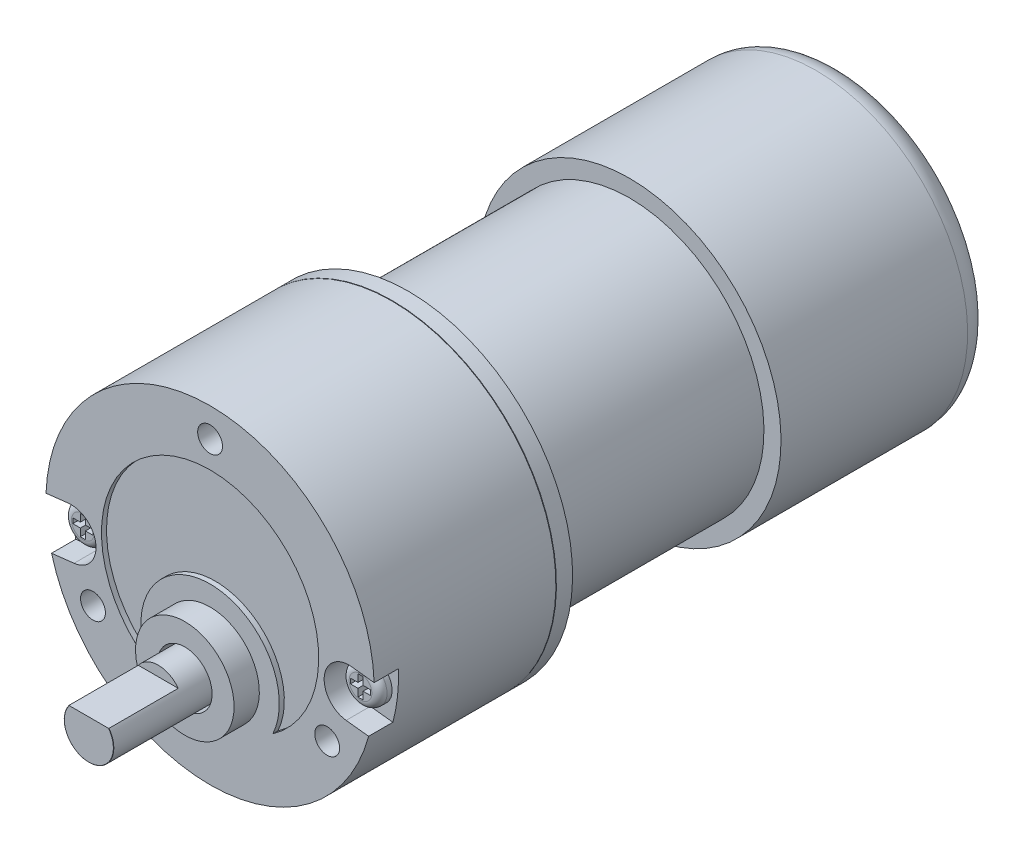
from build123d import *

# Parameters (mm, degrees)
SKETCH2_R                 = 4.953
SKETCH2_R_2               = 2.7432
BOSS_EXTRUDE1_DEPTH       = 2.54
SKETCH2_4_R               = 2.4892
BOSS_EXTRUDE2_DEPTH       = 12.192
CUT_EXTRUDE1_DEPTH        = 0.508
CUT_EXTRUDE4_DEPTH        = 2.4384
M3X0_5_TAPPED_HOLE1_D     = 2.5
M3X0_5_TAPPED_HOLE1_DEPTH = 7.62
M3X0_5_TAPPED_HOLE1_TIP   = 0.751075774
SKETCH7_R                 = 1.905
BOSS_EXTRUDE3_DEPTH       = 1.27
FILLET1_R                 = 0.762
CUT_EXTRUDE5_START        = -6.985
CUT_EXTRUDE5_DEPTH        = 6.985
FILLET2_R                 = 0.0254


with BuildPart() as part:
    # Sketch1 → Revolve1 (revolve)
    with BuildSketch(Plane(origin=(0, 0, 0), x_dir=(0, 0, -1), z_dir=(1, 0, 0))):
        with BuildLine():
            ThreePointArc((65.649974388, 2.168025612), (66.314610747, 1.173327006), (66.548, 0))
            Line((66.548, 0), (64.751948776, 0))
            Line((64.751948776, 0), (0, 0))
            Line((0, 0), (0, 16.51))
            Line((0, 16.51), (18.2626, 16.51))
            Line((18.2626, 16.51), (18.288, 16.4846))
            Line((18.288, 16.4846), (18.3134, 16.51))
            Line((18.3134, 16.51), (19.939, 16.51))
            Line((19.939, 16.51), (19.939, 13.5255))
            Line((19.939, 13.5255), (42.164, 13.5255))
            Line((42.164, 13.5255), (42.164, 15.24))
            Line((42.164, 15.24), (60.928703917, 15.24))
            ThreePointArc((60.928703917, 15.24), (62.640608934, 14.57642778), (63.458047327, 12.932426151))
            Line((63.458047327, 12.932426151), (64.321298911, 3.538217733))
            ThreePointArc((64.321298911, 3.538217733), (64.33278249, 3.495915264), (64.35796352, 3.46003648))
            Line((64.35796352, 3.46003648), (65.649974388, 2.168025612))
        make_face()
    revolve(axis=Axis((0, 0, -64.751948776), (0, 0, 1)))

    # Sketch2 → Boss-Extrude1 (add)
    with BuildSketch(Plane.XY):
        with Locations(Location((0, -5.969, 0), (0, 0, 90))):
            Circle(SKETCH2_R)
        with Locations((0, -5.969)):
            Circle(SKETCH2_R_2, mode=Mode.SUBTRACT)
    extrude(amount=BOSS_EXTRUDE1_DEPTH)

    # Sketch2_4 → Boss-Extrude2 (add)
    with BuildSketch(Plane.XY):
        with Locations(Location((0, -5.969, 0), (0, 0, 180))):
            Circle(SKETCH2_4_R)
    extrude(amount=BOSS_EXTRUDE2_DEPTH)

    # Sketch2_5 → Cut-Extrude1 (cut)
    with BuildSketch(Plane.XY):
        with BuildLine():
            ThreePointArc((6.303140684, -8.919669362), (0, 0.9906), (-6.303140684, -8.919669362))
            ThreePointArc((-6.303140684, -8.919669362), (0, 10.922), (6.303140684, -8.919669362))
        make_face()
    extrude(amount=-CUT_EXTRUDE1_DEPTH, mode=Mode.SUBTRACT)

    # Sketch2_6 → Cut-Extrude4 (cut)
    with BuildSketch(Plane.XY):
        with BuildLine():
            Line((-16.710358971, 0.61601369), (-16.151132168, -4.330877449))
            Line((-16.151132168, -4.330877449), (-13.677686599, -4.051264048))
            ThreePointArc((-13.677686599, -4.051264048), (-11.48385443, -1.298205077), (-14.236913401, 0.895627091))
            Line((-14.236913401, 0.895627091), (-16.710358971, 0.61601369))
        make_face()
        with BuildLine():
            Line((16.710358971, 0.61601369), (14.236913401, 0.895627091))
            ThreePointArc((14.236913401, 0.895627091), (11.48385443, -1.298205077), (13.677686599, -4.051264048))
            Line((13.677686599, -4.051264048), (16.151132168, -4.330877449))
            Line((16.151132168, -4.330877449), (16.710358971, 0.61601369))
        make_face()
    extrude(amount=-CUT_EXTRUDE4_DEPTH, mode=Mode.SUBTRACT)

    # M3x0.5 Tapped Hole1
    with Locations(Plane.XY):
        with Locations((0, 13.594173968), (-11.7729, -6.797086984), (11.7729, -6.797086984)):
            Hole(M3X0_5_TAPPED_HOLE1_D / 2, depth=M3X0_5_TAPPED_HOLE1_DEPTH)
            with Locations((0, 0, -(M3X0_5_TAPPED_HOLE1_DEPTH + M3X0_5_TAPPED_HOLE1_TIP / 2))):  # 118° drill point
                Cone(0, M3X0_5_TAPPED_HOLE1_D / 2, M3X0_5_TAPPED_HOLE1_TIP, mode=Mode.SUBTRACT)

    # Sketch7 → Boss-Extrude3 (add)
    # profile 1 of 2: a face of its own
    with BuildSketch(Plane.XY.offset(-2.4384)):
        with Locations((-13.9573, -1.577818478)):
            Circle(SKETCH7_R)
        Polygon((-14.2113, -1.323818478), (-14.2113, -0.561818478), (-13.7033, -0.561818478), (-13.7033, -1.323818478), (-12.9413, -1.323818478), (-12.9413, -1.831818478), (-13.7033, -1.831818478), (-13.7033, -2.593818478), (-14.2113, -2.593818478), (-14.2113, -1.831818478), (-14.9733, -1.831818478), (-14.9733, -1.323818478), align=None, mode=Mode.SUBTRACT)
    # profile 2 of 2: a face of its own
    with BuildSketch(Plane.XY.offset(-2.4384)):
        with Locations((13.9573, -1.577818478)):
            Circle(SKETCH7_R)
        Polygon((13.7033, -1.323818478), (13.7033, -0.561818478), (14.2113, -0.561818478), (14.2113, -1.323818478), (14.9733, -1.323818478), (14.9733, -1.831818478), (14.2113, -1.831818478), (14.2113, -2.593818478), (13.7033, -2.593818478), (13.7033, -1.831818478), (12.9413, -1.831818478), (12.9413, -1.323818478), align=None, mode=Mode.SUBTRACT)
    extrude(amount=BOSS_EXTRUDE3_DEPTH)

    # Fillet1
    fillet1_edges = [part.edges().sort_by_distance(p)[0] for p in [
        (12.0523, -1.577818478, -1.1684),
        (-15.8623, -1.577818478, -1.1684),
    ]]
    fillet(fillet1_edges, radius=FILLET1_R)

    # Sketch8 → Cut-Extrude5 (cut)
    with BuildSketch(Plane.XY.offset(12.192).offset(CUT_EXTRUDE5_START)):
        with BuildLine():
            Line((-2.006439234, -4.4958), (2.006439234, -4.4958))
            ThreePointArc((2.006439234, -4.4958), (0, -3.4798), (-2.006439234, -4.4958))
        make_face()
    extrude(amount=CUT_EXTRUDE5_DEPTH, mode=Mode.SUBTRACT)

    # Fillet2
    fillet2_edges = [part.edges().sort_by_distance(p)[0] for p in [
        (0.775141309, -8.334432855, 12.192),
    ]]
    fillet(fillet2_edges, radius=FILLET2_R)


solid = part.part
